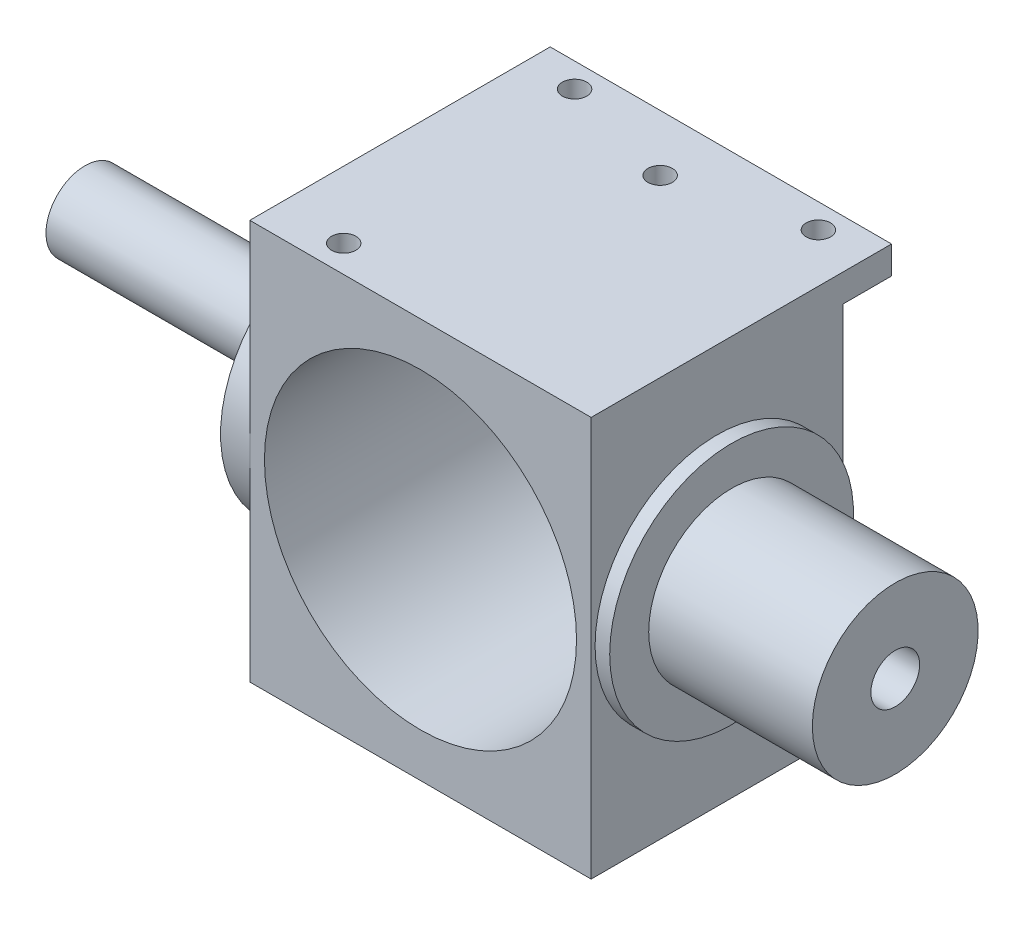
ISO-10303-21;
HEADER;
FILE_DESCRIPTION(('STEP AP214'),'2;1');
FILE_NAME('part.step','',(''),(''),'','','');
FILE_SCHEMA(('AUTOMOTIVE_DESIGN { 1 0 10303 214 1 1 1 1 }'));
ENDSEC;
DATA;
#1=APPLICATION_CONTEXT('core data for automotive mechanical design processes');
#2=APPLICATION_PROTOCOL_DEFINITION('international standard','automotive_design',2000,#1);
#3=PRODUCT_CONTEXT('',#1,'mechanical');
#4=PRODUCT('Part','Part','',(#3));
#5=PRODUCT_RELATED_PRODUCT_CATEGORY('part','',(#4));
#6=PRODUCT_DEFINITION_FORMATION('','',#4);
#7=PRODUCT_DEFINITION_CONTEXT('part definition',#1,'design');
#8=PRODUCT_DEFINITION('design','',#6,#7);
#9=PRODUCT_DEFINITION_SHAPE('','',#8);
#10=(LENGTH_UNIT() NAMED_UNIT(*) SI_UNIT(.MILLI.,.METRE.));
#11=(NAMED_UNIT(*) PLANE_ANGLE_UNIT() SI_UNIT($,.RADIAN.));
#12=(NAMED_UNIT(*) SI_UNIT($,.STERADIAN.) SOLID_ANGLE_UNIT());
#13=UNCERTAINTY_MEASURE_WITH_UNIT(LENGTH_MEASURE(1.E-05),#10,'distance_accuracy_value','');
#14=(GEOMETRIC_REPRESENTATION_CONTEXT(3) GLOBAL_UNCERTAINTY_ASSIGNED_CONTEXT((#13)) GLOBAL_UNIT_ASSIGNED_CONTEXT((#10,
#11,#12)) REPRESENTATION_CONTEXT('',''));
#15=CARTESIAN_POINT('',(0.,0.,0.));
#16=DIRECTION('',(0.,0.,1.));
#17=DIRECTION('',(1.,0.,0.));
#18=AXIS2_PLACEMENT_3D('',#15,#16,#17);
#19=CARTESIAN_POINT('',(53.5807438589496,27.618402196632,37.7129267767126));
#20=DIRECTION('',(-1.,0.,0.));
#21=DIRECTION('',(0.,0.,1.));
#22=AXIS2_PLACEMENT_3D('',#19,#20,#21);
#23=CYLINDRICAL_SURFACE('',#22,8.5);
#24=CARTESIAN_POINT('',(53.5807438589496,27.618402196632,37.7129267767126));
#25=DIRECTION('',(-1.,0.,0.));
#26=DIRECTION('',(0.,0.,1.));
#27=AXIS2_PLACEMENT_3D('',#24,#25,#26);
#28=CIRCLE('',#27,8.5);
#29=CARTESIAN_POINT('',(53.5807438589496,27.618402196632,46.2129267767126));
#30=VERTEX_POINT('',#29);
#31=EDGE_CURVE('E11',#30,#30,#28,.T.);
#32=ORIENTED_EDGE('',*,*,#31,.T.);
#33=EDGE_LOOP('',(#32));
#34=FACE_BOUND('',#33,.T.);
#35=CARTESIAN_POINT('',(36.7995438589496,27.618402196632,37.7129267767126));
#36=DIRECTION('',(-1.,0.,0.));
#37=DIRECTION('',(0.,0.,1.));
#38=AXIS2_PLACEMENT_3D('',#35,#36,#37);
#39=CIRCLE('',#38,8.5);
#40=CARTESIAN_POINT('',(36.7995438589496,27.618402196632,46.2129267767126));
#41=VERTEX_POINT('',#40);
#42=EDGE_CURVE('E56',#41,#41,#39,.T.);
#43=ORIENTED_EDGE('',*,*,#42,.F.);
#44=EDGE_LOOP('',(#43));
#45=FACE_BOUND('',#44,.T.);
#46=ADVANCED_FACE('F42',(#34,#45),#23,.T.);
#47=CARTESIAN_POINT('',(53.5807438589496,36.118402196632,37.7129267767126));
#48=DIRECTION('',(1.,0.,0.));
#49=DIRECTION('',(0.,0.,-1.));
#50=AXIS2_PLACEMENT_3D('',#47,#48,#49);
#51=PLANE('',#50);
#52=CARTESIAN_POINT('',(53.5807438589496,27.618402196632,37.7129267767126));
#53=DIRECTION('',(1.,0.,0.));
#54=DIRECTION('',(0.,0.,-1.));
#55=AXIS2_PLACEMENT_3D('',#52,#53,#54);
#56=CIRCLE('',#55,2.49999999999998);
#57=CARTESIAN_POINT('',(53.5807438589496,27.618402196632,35.2129267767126));
#58=VERTEX_POINT('',#57);
#59=EDGE_CURVE('E64',#58,#58,#56,.T.);
#60=ORIENTED_EDGE('',*,*,#59,.F.);
#61=EDGE_LOOP('',(#60));
#62=FACE_BOUND('',#61,.T.);
#63=ORIENTED_EDGE('',*,*,#31,.F.);
#64=EDGE_LOOP('',(#63));
#65=FACE_BOUND('',#64,.T.);
#66=ADVANCED_FACE('F71',(#62,#65),#51,.T.);
#67=CARTESIAN_POINT('',(35.2995438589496,27.618402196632,37.7129267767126));
#68=DIRECTION('',(-1.,0.,0.));
#69=DIRECTION('',(0.,0.,1.));
#70=AXIS2_PLACEMENT_3D('',#67,#68,#69);
#71=PLANE('',#70);
#72=CARTESIAN_POINT('',(35.2995438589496,27.618402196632,37.7129267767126));
#73=DIRECTION('',(-1.,0.,0.));
#74=DIRECTION('',(0.,0.,1.));
#75=AXIS2_PLACEMENT_3D('',#72,#73,#74);
#76=CIRCLE('',#75,2.49999999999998);
#77=CARTESIAN_POINT('',(35.2995438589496,27.618402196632,40.2129267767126));
#78=VERTEX_POINT('',#77);
#79=EDGE_CURVE('E61',#78,#78,#76,.T.);
#80=ORIENTED_EDGE('',*,*,#79,.F.);
#81=EDGE_LOOP('',(#80));
#82=FACE_BOUND('',#81,.T.);
#83=CARTESIAN_POINT('',(35.2995438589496,27.618402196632,37.7129267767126));
#84=DIRECTION('',(-1.,0.,0.));
#85=DIRECTION('',(0.,0.,1.));
#86=AXIS2_PLACEMENT_3D('',#83,#84,#85);
#87=CIRCLE('',#86,12.5);
#88=CARTESIAN_POINT('',(35.2995438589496,27.618402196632,50.2129267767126));
#89=VERTEX_POINT('',#88);
#90=EDGE_CURVE('E48',#89,#89,#87,.T.);
#91=ORIENTED_EDGE('',*,*,#90,.T.);
#92=EDGE_LOOP('',(#91));
#93=FACE_BOUND('',#92,.T.);
#94=ADVANCED_FACE('F74',(#82,#93),#71,.T.);
#95=CARTESIAN_POINT('',(53.5807438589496,27.618402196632,37.7129267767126));
#96=DIRECTION('',(-1.,0.,0.));
#97=DIRECTION('',(0.,0.,1.));
#98=AXIS2_PLACEMENT_3D('',#95,#96,#97);
#99=CYLINDRICAL_SURFACE('',#98,12.5);
#100=CARTESIAN_POINT('',(36.7995438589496,27.618402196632,37.7129267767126));
#101=DIRECTION('',(-1.,0.,0.));
#102=DIRECTION('',(0.,0.,1.));
#103=AXIS2_PLACEMENT_3D('',#100,#101,#102);
#104=CIRCLE('',#103,12.5);
#105=CARTESIAN_POINT('',(36.7995438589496,27.618402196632,50.2129267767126));
#106=VERTEX_POINT('',#105);
#107=EDGE_CURVE('E52',#106,#106,#104,.T.);
#108=ORIENTED_EDGE('',*,*,#107,.T.);
#109=EDGE_LOOP('',(#108));
#110=FACE_BOUND('',#109,.T.);
#111=ORIENTED_EDGE('',*,*,#90,.F.);
#112=EDGE_LOOP('',(#111));
#113=FACE_BOUND('',#112,.T.);
#114=ADVANCED_FACE('F79',(#110,#113),#99,.T.);
#115=CARTESIAN_POINT('',(36.7995438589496,40.118402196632,37.7129267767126));
#116=DIRECTION('',(1.,0.,0.));
#117=DIRECTION('',(0.,0.,-1.));
#118=AXIS2_PLACEMENT_3D('',#115,#116,#117);
#119=PLANE('',#118);
#120=ORIENTED_EDGE('',*,*,#42,.T.);
#121=EDGE_LOOP('',(#120));
#122=FACE_BOUND('',#121,.T.);
#123=ORIENTED_EDGE('',*,*,#107,.F.);
#124=EDGE_LOOP('',(#123));
#125=FACE_BOUND('',#124,.T.);
#126=ADVANCED_FACE('F85',(#122,#125),#119,.T.);
#127=CARTESIAN_POINT('',(53.5807438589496,27.618402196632,37.7129267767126));
#128=DIRECTION('',(1.,0.,0.));
#129=DIRECTION('',(0.,0.,-1.));
#130=AXIS2_PLACEMENT_3D('',#127,#128,#129);
#131=CYLINDRICAL_SURFACE('',#130,2.49999999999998);
#132=ORIENTED_EDGE('',*,*,#59,.T.);
#133=EDGE_LOOP('',(#132));
#134=FACE_BOUND('',#133,.T.);
#135=ORIENTED_EDGE('',*,*,#79,.T.);
#136=EDGE_LOOP('',(#135));
#137=FACE_BOUND('',#136,.T.);
#138=ADVANCED_FACE('F68',(#134,#137),#131,.F.);
#139=CLOSED_SHELL('',(#46,#66,#94,#114,#126,#138));
#140=MANIFOLD_SOLID_BREP('B2',#139);
#141=CARTESIAN_POINT('',(0.,0.,19.8129267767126));
#142=DIRECTION('',(0.,0.,-1.));
#143=DIRECTION('',(-1.,0.,0.));
#144=AXIS2_PLACEMENT_3D('',#141,#142,#143);
#145=PLANE('',#144);
#146=DIRECTION('',(-1.,0.,0.));
#147=VECTOR('',#146,1.);
#148=CARTESIAN_POINT('',(0.,10.118402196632,19.8129267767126));
#149=LINE('',#148,#147);
#150=CARTESIAN_POINT('',(35.2995438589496,10.118402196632,19.8129267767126));
#151=VERTEX_POINT('',#150);
#152=CARTESIAN_POINT('',(0.299543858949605,10.118402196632,19.8129267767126));
#153=VERTEX_POINT('',#152);
#154=EDGE_CURVE('E153',#151,#153,#149,.T.);
#155=ORIENTED_EDGE('',*,*,#154,.F.);
#156=DIRECTION('',(0.,-1.,0.));
#157=VECTOR('',#156,1.);
#158=CARTESIAN_POINT('',(35.2995438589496,48.118402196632,19.8129267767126));
#159=LINE('',#158,#157);
#160=CARTESIAN_POINT('',(35.2995438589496,7.11840219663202,19.8129267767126));
#161=VERTEX_POINT('',#160);
#162=EDGE_CURVE('E280',#151,#161,#159,.T.);
#163=ORIENTED_EDGE('',*,*,#162,.T.);
#164=DIRECTION('',(-1.,0.,0.));
#165=VECTOR('',#164,1.);
#166=CARTESIAN_POINT('',(35.2995438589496,7.11840219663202,19.8129267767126));
#167=LINE('',#166,#165);
#168=CARTESIAN_POINT('',(0.299543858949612,7.11840219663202,19.8129267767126));
#169=VERTEX_POINT('',#168);
#170=EDGE_CURVE('E264',#161,#169,#167,.T.);
#171=ORIENTED_EDGE('',*,*,#170,.T.);
#172=DIRECTION('',(0.,1.,0.));
#173=VECTOR('',#172,1.);
#174=CARTESIAN_POINT('',(0.299543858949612,7.11840219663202,19.8129267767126));
#175=LINE('',#174,#173);
#176=EDGE_CURVE('E274',#169,#153,#175,.T.);
#177=ORIENTED_EDGE('',*,*,#176,.T.);
#178=EDGE_LOOP('',(#155,#163,#171,#177));
#179=FACE_BOUND('',#178,.T.);
#180=ADVANCED_FACE('F141',(#179),#145,.T.);
#181=CARTESIAN_POINT('',(0.299543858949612,7.11840219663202,50.6129267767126));
#182=DIRECTION('',(-1.,0.,0.));
#183=DIRECTION('',(0.,-1.,0.));
#184=AXIS2_PLACEMENT_3D('',#181,#182,#183);
#185=PLANE('',#184);
#186=DIRECTION('',(0.,0.,1.));
#187=VECTOR('',#186,1.);
#188=CARTESIAN_POINT('',(0.299543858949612,10.118402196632,50.6129267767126));
#189=LINE('',#188,#187);
#190=CARTESIAN_POINT('',(0.299543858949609,10.118402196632,24.8129267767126));
#191=VERTEX_POINT('',#190);
#192=EDGE_CURVE('E255',#153,#191,#189,.T.);
#193=ORIENTED_EDGE('',*,*,#192,.F.);
#194=ORIENTED_EDGE('',*,*,#176,.F.);
#195=DIRECTION('',(0.,0.,-1.));
#196=VECTOR('',#195,1.);
#197=CARTESIAN_POINT('',(0.299543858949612,7.11840219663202,50.6129267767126));
#198=LINE('',#197,#196);
#199=CARTESIAN_POINT('',(0.299543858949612,7.11840219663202,50.6129267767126));
#200=VERTEX_POINT('',#199);
#201=EDGE_CURVE('E286',#200,#169,#198,.T.);
#202=ORIENTED_EDGE('',*,*,#201,.F.);
#203=DIRECTION('',(0.,1.,0.));
#204=VECTOR('',#203,1.);
#205=CARTESIAN_POINT('',(0.299543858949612,7.11840219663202,50.6129267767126));
#206=LINE('',#205,#204);
#207=CARTESIAN_POINT('',(0.299543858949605,48.118402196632,50.6129267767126));
#208=VERTEX_POINT('',#207);
#209=EDGE_CURVE('E260',#200,#208,#206,.T.);
#210=ORIENTED_EDGE('',*,*,#209,.T.);
#211=DIRECTION('',(0.,0.,-1.));
#212=VECTOR('',#211,1.);
#213=CARTESIAN_POINT('',(0.299543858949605,48.118402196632,50.6129267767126));
#214=LINE('',#213,#212);
#215=CARTESIAN_POINT('',(0.299543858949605,48.118402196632,19.8129267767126));
#216=VERTEX_POINT('',#215);
#217=EDGE_CURVE('E273',#208,#216,#214,.T.);
#218=ORIENTED_EDGE('',*,*,#217,.T.);
#219=CARTESIAN_POINT('',(0.299543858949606,45.272002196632,19.8129267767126));
#220=VERTEX_POINT('',#219);
#221=EDGE_CURVE('E259',#220,#216,#175,.T.);
#222=ORIENTED_EDGE('',*,*,#221,.F.);
#223=DIRECTION('',(0.,0.,-1.));
#224=VECTOR('',#223,1.);
#225=CARTESIAN_POINT('',(0.299543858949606,45.272002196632,50.6129267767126));
#226=LINE('',#225,#224);
#227=CARTESIAN_POINT('',(0.299543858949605,45.272002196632,24.8129267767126));
#228=VERTEX_POINT('',#227);
#229=EDGE_CURVE('E167',#228,#220,#226,.T.);
#230=ORIENTED_EDGE('',*,*,#229,.F.);
#231=DIRECTION('',(0.,1.,0.));
#232=VECTOR('',#231,1.);
#233=CARTESIAN_POINT('',(0.299543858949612,7.11840219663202,24.8129267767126));
#234=LINE('',#233,#232);
#235=EDGE_CURVE('E257',#191,#228,#234,.T.);
#236=ORIENTED_EDGE('',*,*,#235,.F.);
#237=EDGE_LOOP('',(#193,#194,#202,#210,#218,#222,#230,#236));
#238=FACE_BOUND('',#237,.T.);
#239=ADVANCED_FACE('F345',(#238),#185,.T.);
#240=CARTESIAN_POINT('',(35.2995438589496,7.11840219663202,50.6129267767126));
#241=DIRECTION('',(0.,-1.,0.));
#242=DIRECTION('',(0.,0.,-1.));
#243=AXIS2_PLACEMENT_3D('',#240,#241,#242);
#244=PLANE('',#243);
#245=CARTESIAN_POINT('',(5.29954385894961,7.11840219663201,22.3129267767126));
#246=DIRECTION('',(0.,1.,0.));
#247=DIRECTION('',(0.,0.,1.));
#248=AXIS2_PLACEMENT_3D('',#245,#246,#247);
#249=CIRCLE('',#248,1.24999999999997);
#250=CARTESIAN_POINT('',(5.29954385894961,7.11840219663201,23.5629267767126));
#251=VERTEX_POINT('',#250);
#252=EDGE_CURVE('E409',#251,#251,#249,.T.);
#253=ORIENTED_EDGE('',*,*,#252,.T.);
#254=EDGE_LOOP('',(#253));
#255=FACE_BOUND('',#254,.T.);
#256=CARTESIAN_POINT('',(30.2995438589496,7.11840219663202,22.3129267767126));
#257=DIRECTION('',(0.,1.,0.));
#258=DIRECTION('',(0.,0.,1.));
#259=AXIS2_PLACEMENT_3D('',#256,#257,#258);
#260=CIRCLE('',#259,1.24999999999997);
#261=CARTESIAN_POINT('',(30.2995438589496,7.11840219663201,23.5629267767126));
#262=VERTEX_POINT('',#261);
#263=EDGE_CURVE('E403',#262,#262,#260,.T.);
#264=ORIENTED_EDGE('',*,*,#263,.T.);
#265=EDGE_LOOP('',(#264));
#266=FACE_BOUND('',#265,.T.);
#267=ORIENTED_EDGE('',*,*,#170,.F.);
#268=DIRECTION('',(0.,0.,-1.));
#269=VECTOR('',#268,1.);
#270=CARTESIAN_POINT('',(35.2995438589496,7.11840219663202,50.6129267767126));
#271=LINE('',#270,#269);
#272=CARTESIAN_POINT('',(35.2995438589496,7.11840219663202,50.6129267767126));
#273=VERTEX_POINT('',#272);
#274=EDGE_CURVE('E289',#273,#161,#271,.T.);
#275=ORIENTED_EDGE('',*,*,#274,.F.);
#276=DIRECTION('',(-1.,0.,0.));
#277=VECTOR('',#276,1.);
#278=CARTESIAN_POINT('',(35.2995438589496,7.11840219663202,50.6129267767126));
#279=LINE('',#278,#277);
#280=EDGE_CURVE('E270',#273,#200,#279,.T.);
#281=ORIENTED_EDGE('',*,*,#280,.T.);
#282=ORIENTED_EDGE('',*,*,#201,.T.);
#283=EDGE_LOOP('',(#267,#275,#281,#282));
#284=FACE_BOUND('',#283,.T.);
#285=ADVANCED_FACE('F352',(#255,#266,#284),#244,.T.);
#286=CARTESIAN_POINT('',(35.2995438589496,48.118402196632,50.6129267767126));
#287=DIRECTION('',(1.,0.,0.));
#288=DIRECTION('',(0.,1.,0.));
#289=AXIS2_PLACEMENT_3D('',#286,#287,#288);
#290=PLANE('',#289);
#291=CARTESIAN_POINT('',(35.2995438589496,27.618402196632,37.7129267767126));
#292=DIRECTION('',(1.,0.,0.));
#293=DIRECTION('',(0.,1.,0.));
#294=AXIS2_PLACEMENT_3D('',#291,#292,#293);
#295=CIRCLE('',#294,2.49999999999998);
#296=CARTESIAN_POINT('',(35.2995438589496,30.118402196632,37.7129267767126));
#297=VERTEX_POINT('',#296);
#298=EDGE_CURVE('E241',#297,#297,#295,.T.);
#299=ORIENTED_EDGE('',*,*,#298,.F.);
#300=EDGE_LOOP('',(#299));
#301=FACE_BOUND('',#300,.T.);
#302=DIRECTION('',(0.,0.,-1.));
#303=VECTOR('',#302,1.);
#304=CARTESIAN_POINT('',(35.2995438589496,10.118402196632,24.8129267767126));
#305=LINE('',#304,#303);
#306=CARTESIAN_POINT('',(35.2995438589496,10.118402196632,24.8129267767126));
#307=VERTEX_POINT('',#306);
#308=EDGE_CURVE('E235',#307,#151,#305,.T.);
#309=ORIENTED_EDGE('',*,*,#308,.F.);
#310=DIRECTION('',(0.,-1.,0.));
#311=VECTOR('',#310,1.);
#312=CARTESIAN_POINT('',(35.2995438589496,45.272002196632,24.8129267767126));
#313=LINE('',#312,#311);
#314=CARTESIAN_POINT('',(35.2995438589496,45.272002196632,24.8129267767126));
#315=VERTEX_POINT('',#314);
#316=EDGE_CURVE('E247',#315,#307,#313,.T.);
#317=ORIENTED_EDGE('',*,*,#316,.F.);
#318=DIRECTION('',(0.,0.,1.));
#319=VECTOR('',#318,1.);
#320=CARTESIAN_POINT('',(35.2995438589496,45.272002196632,19.8129267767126));
#321=LINE('',#320,#319);
#322=CARTESIAN_POINT('',(35.2995438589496,45.272002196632,19.8129267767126));
#323=VERTEX_POINT('',#322);
#324=EDGE_CURVE('E238',#323,#315,#321,.T.);
#325=ORIENTED_EDGE('',*,*,#324,.F.);
#326=CARTESIAN_POINT('',(35.2995438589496,48.118402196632,19.8129267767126));
#327=VERTEX_POINT('',#326);
#328=EDGE_CURVE('E281',#327,#323,#159,.T.);
#329=ORIENTED_EDGE('',*,*,#328,.F.);
#330=DIRECTION('',(0.,0.,-1.));
#331=VECTOR('',#330,1.);
#332=CARTESIAN_POINT('',(35.2995438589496,48.118402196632,50.6129267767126));
#333=LINE('',#332,#331);
#334=CARTESIAN_POINT('',(35.2995438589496,48.118402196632,50.6129267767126));
#335=VERTEX_POINT('',#334);
#336=EDGE_CURVE('E292',#335,#327,#333,.T.);
#337=ORIENTED_EDGE('',*,*,#336,.F.);
#338=DIRECTION('',(0.,-1.,0.));
#339=VECTOR('',#338,1.);
#340=CARTESIAN_POINT('',(35.2995438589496,48.118402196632,50.6129267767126));
#341=LINE('',#340,#339);
#342=EDGE_CURVE('E267',#335,#273,#341,.T.);
#343=ORIENTED_EDGE('',*,*,#342,.T.);
#344=ORIENTED_EDGE('',*,*,#274,.T.);
#345=ORIENTED_EDGE('',*,*,#162,.F.);
#346=EDGE_LOOP('',(#309,#317,#325,#329,#337,#343,#344,#345));
#347=FACE_BOUND('',#346,.T.);
#348=ADVANCED_FACE('F381',(#301,#347),#290,.T.);
#349=CARTESIAN_POINT('',(0.299543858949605,48.118402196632,50.6129267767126));
#350=DIRECTION('',(0.,1.,0.));
#351=DIRECTION('',(0.,0.,1.));
#352=AXIS2_PLACEMENT_3D('',#349,#350,#351);
#353=PLANE('',#352);
#354=CARTESIAN_POINT('',(5.29954385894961,48.118402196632,22.3129267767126));
#355=DIRECTION('',(0.,-1.,0.));
#356=DIRECTION('',(0.,0.,-1.));
#357=AXIS2_PLACEMENT_3D('',#354,#355,#356);
#358=CIRCLE('',#357,1.24999999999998);
#359=CARTESIAN_POINT('',(5.29954385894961,48.118402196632,21.0629267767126));
#360=VERTEX_POINT('',#359);
#361=EDGE_CURVE('E397',#360,#360,#358,.T.);
#362=ORIENTED_EDGE('',*,*,#361,.T.);
#363=EDGE_LOOP('',(#362));
#364=FACE_BOUND('',#363,.T.);
#365=CARTESIAN_POINT('',(30.2995438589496,48.118402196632,22.3129267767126));
#366=DIRECTION('',(0.,-1.,0.));
#367=DIRECTION('',(0.,0.,-1.));
#368=AXIS2_PLACEMENT_3D('',#365,#366,#367);
#369=CIRCLE('',#368,1.24999999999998);
#370=CARTESIAN_POINT('',(30.2995438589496,48.118402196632,21.0629267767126));
#371=VERTEX_POINT('',#370);
#372=EDGE_CURVE('E391',#371,#371,#369,.T.);
#373=ORIENTED_EDGE('',*,*,#372,.T.);
#374=EDGE_LOOP('',(#373));
#375=FACE_BOUND('',#374,.T.);
#376=CARTESIAN_POINT('',(17.3495438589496,48.118402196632,25.5879267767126));
#377=DIRECTION('',(0.,1.,0.));
#378=DIRECTION('',(0.,0.,1.));
#379=AXIS2_PLACEMENT_3D('',#376,#377,#378);
#380=CIRCLE('',#379,1.24999999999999);
#381=CARTESIAN_POINT('',(17.3495438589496,48.118402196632,26.8379267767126));
#382=VERTEX_POINT('',#381);
#383=EDGE_CURVE('E232',#382,#382,#380,.T.);
#384=ORIENTED_EDGE('',*,*,#383,.F.);
#385=EDGE_LOOP('',(#384));
#386=FACE_BOUND('',#385,.T.);
#387=CARTESIAN_POINT('',(7.1495438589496,48.118402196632,47.8379267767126));
#388=DIRECTION('',(0.,1.,0.));
#389=DIRECTION('',(0.,0.,1.));
#390=AXIS2_PLACEMENT_3D('',#387,#388,#389);
#391=CIRCLE('',#390,1.24999999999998);
#392=CARTESIAN_POINT('',(7.1495438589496,48.118402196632,49.0879267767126));
#393=VERTEX_POINT('',#392);
#394=EDGE_CURVE('E306',#393,#393,#391,.T.);
#395=ORIENTED_EDGE('',*,*,#394,.F.);
#396=EDGE_LOOP('',(#395));
#397=FACE_BOUND('',#396,.T.);
#398=DIRECTION('',(1.,0.,0.));
#399=VECTOR('',#398,1.);
#400=CARTESIAN_POINT('',(0.299543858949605,48.118402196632,19.8129267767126));
#401=LINE('',#400,#399);
#402=EDGE_CURVE('E277',#216,#327,#401,.T.);
#403=ORIENTED_EDGE('',*,*,#402,.F.);
#404=ORIENTED_EDGE('',*,*,#217,.F.);
#405=DIRECTION('',(1.,0.,0.));
#406=VECTOR('',#405,1.);
#407=CARTESIAN_POINT('',(0.299543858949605,48.118402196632,50.6129267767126));
#408=LINE('',#407,#406);
#409=EDGE_CURVE('E263',#208,#335,#408,.T.);
#410=ORIENTED_EDGE('',*,*,#409,.T.);
#411=ORIENTED_EDGE('',*,*,#336,.T.);
#412=EDGE_LOOP('',(#403,#404,#410,#411));
#413=FACE_BOUND('',#412,.T.);
#414=ADVANCED_FACE('F367',(#364,#375,#386,#397,#413),#353,.T.);
#415=CARTESIAN_POINT('',(0.,0.,50.6129267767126));
#416=DIRECTION('',(0.,0.,-1.));
#417=DIRECTION('',(-1.,0.,0.));
#418=AXIS2_PLACEMENT_3D('',#415,#416,#417);
#419=PLANE('',#418);
#420=CARTESIAN_POINT('',(17.7995438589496,27.618402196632,50.6129267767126));
#421=DIRECTION('',(0.,0.,1.));
#422=DIRECTION('',(1.,0.,0.));
#423=AXIS2_PLACEMENT_3D('',#420,#421,#422);
#424=CIRCLE('',#423,16.);
#425=CARTESIAN_POINT('',(33.7995438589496,27.618402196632,50.6129267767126));
#426=VERTEX_POINT('',#425);
#427=EDGE_CURVE('E236',#426,#426,#424,.T.);
#428=ORIENTED_EDGE('',*,*,#427,.F.);
#429=EDGE_LOOP('',(#428));
#430=FACE_BOUND('',#429,.T.);
#431=ORIENTED_EDGE('',*,*,#209,.F.);
#432=ORIENTED_EDGE('',*,*,#280,.F.);
#433=ORIENTED_EDGE('',*,*,#342,.F.);
#434=ORIENTED_EDGE('',*,*,#409,.F.);
#435=EDGE_LOOP('',(#431,#432,#433,#434));
#436=FACE_BOUND('',#435,.T.);
#437=ADVANCED_FACE('F359',(#430,#436),#419,.F.);
#438=DIRECTION('',(1.,0.,0.));
#439=VECTOR('',#438,1.);
#440=CARTESIAN_POINT('',(0.,45.272002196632,19.8129267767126));
#441=LINE('',#440,#439);
#442=EDGE_CURVE('E288',#220,#323,#441,.T.);
#443=ORIENTED_EDGE('',*,*,#442,.F.);
#444=ORIENTED_EDGE('',*,*,#221,.T.);
#445=ORIENTED_EDGE('',*,*,#402,.T.);
#446=ORIENTED_EDGE('',*,*,#328,.T.);
#447=EDGE_LOOP('',(#443,#444,#445,#446));
#448=FACE_BOUND('',#447,.T.);
#449=ADVANCED_FACE('F348',(#448),#145,.T.);
#450=CARTESIAN_POINT('',(-29.5004561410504,10.118402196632,24.8129267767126));
#451=DIRECTION('',(0.,-1.,0.));
#452=DIRECTION('',(0.,0.,-1.));
#453=AXIS2_PLACEMENT_3D('',#450,#451,#452);
#454=PLANE('',#453);
#455=CARTESIAN_POINT('',(5.29954385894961,10.118402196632,22.3129267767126));
#456=DIRECTION('',(0.,1.,0.));
#457=DIRECTION('',(0.,0.,1.));
#458=AXIS2_PLACEMENT_3D('',#455,#456,#457);
#459=CIRCLE('',#458,1.24999999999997);
#460=CARTESIAN_POINT('',(5.29954385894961,10.118402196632,23.5629267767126));
#461=VERTEX_POINT('',#460);
#462=EDGE_CURVE('E412',#461,#461,#459,.T.);
#463=ORIENTED_EDGE('',*,*,#462,.F.);
#464=EDGE_LOOP('',(#463));
#465=FACE_BOUND('',#464,.T.);
#466=CARTESIAN_POINT('',(30.2995438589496,10.118402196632,22.3129267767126));
#467=DIRECTION('',(0.,1.,0.));
#468=DIRECTION('',(0.,0.,1.));
#469=AXIS2_PLACEMENT_3D('',#466,#467,#468);
#470=CIRCLE('',#469,1.24999999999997);
#471=CARTESIAN_POINT('',(30.2995438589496,10.118402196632,23.5629267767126));
#472=VERTEX_POINT('',#471);
#473=EDGE_CURVE('E406',#472,#472,#470,.T.);
#474=ORIENTED_EDGE('',*,*,#473,.F.);
#475=EDGE_LOOP('',(#474));
#476=FACE_BOUND('',#475,.T.);
#477=ORIENTED_EDGE('',*,*,#192,.T.);
#478=DIRECTION('',(1.,0.,0.));
#479=VECTOR('',#478,1.);
#480=CARTESIAN_POINT('',(-29.5004561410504,10.118402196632,24.8129267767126));
#481=LINE('',#480,#479);
#482=EDGE_CURVE('E251',#191,#307,#481,.T.);
#483=ORIENTED_EDGE('',*,*,#482,.T.);
#484=ORIENTED_EDGE('',*,*,#308,.T.);
#485=ORIENTED_EDGE('',*,*,#154,.T.);
#486=EDGE_LOOP('',(#477,#483,#484,#485));
#487=FACE_BOUND('',#486,.T.);
#488=ADVANCED_FACE('F358',(#465,#476,#487),#454,.F.);
#489=CARTESIAN_POINT('',(-29.5004561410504,45.272002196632,24.8129267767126));
#490=DIRECTION('',(0.,0.,1.));
#491=DIRECTION('',(1.,0.,0.));
#492=AXIS2_PLACEMENT_3D('',#489,#490,#491);
#493=PLANE('',#492);
#494=CARTESIAN_POINT('',(17.7995438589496,27.618402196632,24.8129267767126));
#495=DIRECTION('',(0.,0.,1.));
#496=DIRECTION('',(1.,0.,0.));
#497=AXIS2_PLACEMENT_3D('',#494,#495,#496);
#498=CIRCLE('',#497,16.);
#499=CARTESIAN_POINT('',(16.3687915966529,43.554303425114,24.8129267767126));
#500=VERTEX_POINT('',#499);
#501=CARTESIAN_POINT('',(18.3302961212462,43.6095967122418,24.8129267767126));
#502=VERTEX_POINT('',#501);
#503=EDGE_CURVE('E229',#500,#502,#498,.T.);
#504=ORIENTED_EDGE('',*,*,#503,.T.);
#505=DIRECTION('',(0.,1.,0.));
#506=VECTOR('',#505,1.);
#507=CARTESIAN_POINT('',(18.3302961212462,48.118402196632,24.8129267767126));
#508=LINE('',#507,#506);
#509=CARTESIAN_POINT('',(18.3302961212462,45.272002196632,24.8129267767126));
#510=VERTEX_POINT('',#509);
#511=EDGE_CURVE('E160',#502,#510,#508,.T.);
#512=ORIENTED_EDGE('',*,*,#511,.T.);
#513=DIRECTION('',(1.,0.,0.));
#514=VECTOR('',#513,1.);
#515=CARTESIAN_POINT('',(-29.5004561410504,45.272002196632,24.8129267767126));
#516=LINE('',#515,#514);
#517=EDGE_CURVE('E250',#510,#315,#516,.T.);
#518=ORIENTED_EDGE('',*,*,#517,.T.);
#519=ORIENTED_EDGE('',*,*,#316,.T.);
#520=ORIENTED_EDGE('',*,*,#482,.F.);
#521=ORIENTED_EDGE('',*,*,#235,.T.);
#522=CARTESIAN_POINT('',(16.3687915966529,45.272002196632,24.8129267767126));
#523=VERTEX_POINT('',#522);
#524=EDGE_CURVE('E230',#228,#523,#516,.T.);
#525=ORIENTED_EDGE('',*,*,#524,.T.);
#526=DIRECTION('',(0.,1.,0.));
#527=VECTOR('',#526,1.);
#528=CARTESIAN_POINT('',(16.3687915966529,48.118402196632,24.8129267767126));
#529=LINE('',#528,#527);
#530=EDGE_CURVE('E221',#523,#500,#529,.F.);
#531=ORIENTED_EDGE('',*,*,#530,.T.);
#532=EDGE_LOOP('',(#504,#512,#518,#519,#520,#521,#525,#531));
#533=FACE_BOUND('',#532,.T.);
#534=ADVANCED_FACE('F228',(#533),#493,.F.);
#535=CARTESIAN_POINT('',(-29.5004561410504,45.272002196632,19.8129267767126));
#536=DIRECTION('',(0.,1.,0.));
#537=DIRECTION('',(-1.,0.,0.));
#538=AXIS2_PLACEMENT_3D('',#535,#536,#537);
#539=PLANE('',#538);
#540=CARTESIAN_POINT('',(5.29954385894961,45.272002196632,22.3129267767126));
#541=DIRECTION('',(0.,-1.,0.));
#542=DIRECTION('',(0.,0.,-1.));
#543=AXIS2_PLACEMENT_3D('',#540,#541,#542);
#544=CIRCLE('',#543,1.24999999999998);
#545=CARTESIAN_POINT('',(5.29954385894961,45.272002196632,21.0629267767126));
#546=VERTEX_POINT('',#545);
#547=EDGE_CURVE('E400',#546,#546,#544,.T.);
#548=ORIENTED_EDGE('',*,*,#547,.F.);
#549=EDGE_LOOP('',(#548));
#550=FACE_BOUND('',#549,.T.);
#551=CARTESIAN_POINT('',(30.2995438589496,45.272002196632,22.3129267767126));
#552=DIRECTION('',(0.,-1.,0.));
#553=DIRECTION('',(0.,0.,-1.));
#554=AXIS2_PLACEMENT_3D('',#551,#552,#553);
#555=CIRCLE('',#554,1.24999999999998);
#556=CARTESIAN_POINT('',(30.2995438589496,45.272002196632,21.0629267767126));
#557=VERTEX_POINT('',#556);
#558=EDGE_CURVE('E394',#557,#557,#555,.T.);
#559=ORIENTED_EDGE('',*,*,#558,.F.);
#560=EDGE_LOOP('',(#559));
#561=FACE_BOUND('',#560,.T.);
#562=ORIENTED_EDGE('',*,*,#517,.F.);
#563=CARTESIAN_POINT('',(17.3495438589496,45.272002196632,25.5879267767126));
#564=DIRECTION('',(0.,1.,0.));
#565=DIRECTION('',(-1.,0.,0.));
#566=AXIS2_PLACEMENT_3D('',#563,#564,#565);
#567=CIRCLE('',#566,1.24999999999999);
#568=EDGE_CURVE('E231',#510,#523,#567,.T.);
#569=ORIENTED_EDGE('',*,*,#568,.T.);
#570=ORIENTED_EDGE('',*,*,#524,.F.);
#571=ORIENTED_EDGE('',*,*,#229,.T.);
#572=ORIENTED_EDGE('',*,*,#442,.T.);
#573=ORIENTED_EDGE('',*,*,#324,.T.);
#574=EDGE_LOOP('',(#562,#569,#570,#571,#572,#573));
#575=FACE_BOUND('',#574,.T.);
#576=ADVANCED_FACE('F384',(#550,#561,#575),#539,.F.);
#577=CARTESIAN_POINT('',(17.7995438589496,27.618402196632,50.6129267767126));
#578=DIRECTION('',(0.,0.,1.));
#579=DIRECTION('',(1.,0.,0.));
#580=AXIS2_PLACEMENT_3D('',#577,#578,#579);
#581=CYLINDRICAL_SURFACE('',#580,16.);
#582=CARTESIAN_POINT('',(7.1495438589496,39.5589842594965,49.0879267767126));
#583=CARTESIAN_POINT('',(7.22841025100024,39.6293251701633,49.0879275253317));
#584=CARTESIAN_POINT('',(7.30801002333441,39.698910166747,49.08047969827));
#585=CARTESIAN_POINT('',(7.46693001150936,39.8351136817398,49.0496689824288));
#586=CARTESIAN_POINT('',(7.54624984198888,39.9017289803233,49.0262892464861));
#587=CARTESIAN_POINT('',(7.68975799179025,40.0199943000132,48.9673982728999));
#588=CARTESIAN_POINT('',(7.75437030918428,40.0723540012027,48.9343609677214));
#589=CARTESIAN_POINT('',(7.87937715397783,40.1721529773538,48.8554186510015));
#590=CARTESIAN_POINT('',(7.93977830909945,40.2196000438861,48.8095344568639));
#591=CARTESIAN_POINT('',(8.04276631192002,40.2994395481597,48.7146130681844));
#592=CARTESIAN_POINT('',(8.08655324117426,40.3329771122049,48.6678478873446));
#593=CARTESIAN_POINT('',(8.16778471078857,40.3946228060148,48.5658877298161));
#594=CARTESIAN_POINT('',(8.20523034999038,40.4227318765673,48.5106942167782));
#595=CARTESIAN_POINT('',(8.27201780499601,40.472506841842,48.3921953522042));
#596=CARTESIAN_POINT('',(8.30128811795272,40.4941160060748,48.3288251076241));
#597=CARTESIAN_POINT('',(8.34919589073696,40.5293209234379,48.196107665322));
#598=CARTESIAN_POINT('',(8.36784493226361,40.5429254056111,48.1267670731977));
#599=CARTESIAN_POINT('',(8.39114320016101,40.5598924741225,47.9951784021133));
#600=CARTESIAN_POINT('',(8.39743922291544,40.5644606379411,47.9333734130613));
#601=CARTESIAN_POINT('',(8.40075279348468,40.5668667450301,47.8093958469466));
#602=CARTESIAN_POINT('',(8.39777496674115,40.5647080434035,47.7472234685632));
#603=CARTESIAN_POINT('',(8.38334866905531,40.5542181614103,47.6294308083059));
#604=CARTESIAN_POINT('',(8.37258362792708,40.5463849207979,47.5736793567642));
#605=CARTESIAN_POINT('',(8.34396222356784,40.5254656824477,47.4650743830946));
#606=CARTESIAN_POINT('',(8.32610549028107,40.512379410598,47.4122210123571));
#607=CARTESIAN_POINT('',(8.28334498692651,40.4808548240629,47.3085258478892));
#608=CARTESIAN_POINT('',(8.25818969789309,40.4622247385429,47.2578471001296));
#609=CARTESIAN_POINT('',(8.20230107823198,40.4205170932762,47.1616876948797));
#610=CARTESIAN_POINT('',(8.17156587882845,40.3974380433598,47.1162087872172));
#611=CARTESIAN_POINT('',(8.10134576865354,40.344247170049,47.025347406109));
#612=CARTESIAN_POINT('',(8.06124242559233,40.3136105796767,46.9807524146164));
#613=CARTESIAN_POINT('',(7.97684548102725,40.2484240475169,46.8990281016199));
#614=CARTESIAN_POINT('',(7.93254845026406,40.2138708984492,46.8619049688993));
#615=CARTESIAN_POINT('',(7.81961523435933,40.1247326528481,46.7794290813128));
#616=CARTESIAN_POINT('',(7.74928034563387,40.0683333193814,46.7383400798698));
#617=CARTESIAN_POINT('',(7.6054217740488,39.95082067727,46.6713099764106));
#618=CARTESIAN_POINT('',(7.5318934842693,39.8897004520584,46.6453915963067));
#619=CARTESIAN_POINT('',(7.38288887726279,39.7634819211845,46.6074635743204));
#620=CARTESIAN_POINT('',(7.30739969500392,39.6983399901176,46.5956531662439));
#621=CARTESIAN_POINT('',(7.15718685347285,39.5662162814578,46.5856843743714));
#622=CARTESIAN_POINT('',(7.08246332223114,39.4992342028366,46.5875282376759));
#623=CARTESIAN_POINT('',(6.91951180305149,39.3503879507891,46.6059935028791));
#624=CARTESIAN_POINT('',(6.83176211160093,39.2683664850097,46.6256516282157));
#625=CARTESIAN_POINT('',(6.66133793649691,39.105536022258,46.6836889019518));
#626=CARTESIAN_POINT('',(6.57866491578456,39.0247273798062,46.722073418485));
#627=CARTESIAN_POINT('',(6.43830312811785,38.8847138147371,46.807484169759));
#628=CARTESIAN_POINT('',(6.37913112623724,38.8246817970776,46.8507248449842));
#629=CARTESIAN_POINT('',(6.26696272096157,38.7092092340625,46.9495991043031));
#630=CARTESIAN_POINT('',(6.21395505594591,38.6537603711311,47.0052095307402));
#631=CARTESIAN_POINT('',(6.13101740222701,38.5659134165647,47.1111616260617));
#632=CARTESIAN_POINT('',(6.09890763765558,38.5315586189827,47.1581675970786));
#633=CARTESIAN_POINT('',(6.04022893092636,38.468303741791,47.2588726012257));
#634=CARTESIAN_POINT('',(6.01365193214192,38.4393957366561,47.3125617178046));
#635=CARTESIAN_POINT('',(5.97245995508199,38.3943394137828,47.4144479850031));
#636=CARTESIAN_POINT('',(5.95650734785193,38.3767882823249,47.4614763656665));
#637=CARTESIAN_POINT('',(5.93006427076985,38.3476074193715,47.5588117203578));
#638=CARTESIAN_POINT('',(5.91956915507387,38.3359726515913,47.60911586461));
#639=CARTESIAN_POINT('',(5.90479866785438,38.3195780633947,47.7121089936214));
#640=CARTESIAN_POINT('',(5.90056510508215,38.3148644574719,47.7648116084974));
#641=CARTESIAN_POINT('',(5.89885201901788,38.3129586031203,47.8704596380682));
#642=CARTESIAN_POINT('',(5.90137083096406,38.3157645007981,47.9234049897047));
#643=CARTESIAN_POINT('',(5.91231678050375,38.3279253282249,48.0222889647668));
#644=CARTESIAN_POINT('',(5.92011141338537,38.33657901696,48.0683892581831));
#645=CARTESIAN_POINT('',(5.94039892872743,38.359021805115,48.158227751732));
#646=CARTESIAN_POINT('',(5.95289387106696,38.3728131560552,48.2019649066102));
#647=CARTESIAN_POINT('',(5.98734876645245,38.4106640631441,48.3022171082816));
#648=CARTESIAN_POINT('',(6.01110089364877,38.4366348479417,48.3573928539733));
#649=CARTESIAN_POINT('',(6.06452385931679,38.4945626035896,48.4613572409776));
#650=CARTESIAN_POINT('',(6.09420670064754,38.5265317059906,48.5101325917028));
#651=CARTESIAN_POINT('',(6.17129496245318,38.6087683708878,48.6200435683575));
#652=CARTESIAN_POINT('',(6.22096517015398,38.661150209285,48.6779987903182));
#653=CARTESIAN_POINT('',(6.3267767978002,38.7710469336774,48.7818917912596));
#654=CARTESIAN_POINT('',(6.38293255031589,38.8285731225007,48.827802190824));
#655=CARTESIAN_POINT('',(6.51923298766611,38.9659448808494,48.9214910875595));
#656=CARTESIAN_POINT('',(6.60120687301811,39.046925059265,48.9649481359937));
#657=CARTESIAN_POINT('',(6.77074093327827,39.2106145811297,49.0326314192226));
#658=CARTESIAN_POINT('',(6.85829159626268,39.2933208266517,49.0568894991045));
#659=CARTESIAN_POINT('',(7.01408372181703,39.437119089,49.0823876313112));
#660=CARTESIAN_POINT('',(7.08154116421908,39.498332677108,49.0879261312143));
#661=CARTESIAN_POINT('',(7.1495438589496,39.5589842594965,49.0879267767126));
#662=B_SPLINE_CURVE_WITH_KNOTS('',3,(#582,#583,#584,#585,#586,#587,#588,#589,#590,#591,#592,
#593,#594,#595,#596,#597,#598,#599,#600,#601,#602,#603,#604,#605,#606,#607,#608,#609,#610,#611,
#612,#613,#614,#615,#616,#617,#618,#619,#620,#621,#622,#623,#624,#625,#626,#627,#628,#629,#630,
#631,#632,#633,#634,#635,#636,#637,#638,#639,#640,#641,#642,#643,#644,#645,#646,#647,#648,#649,
#650,#651,#652,#653,#654,#655,#656,#657,#658,#659,#660,#661),.UNSPECIFIED.,.T.,.F.,(4,2,2,2,2,2,
2,2,2,2,2,2,2,2,2,2,2,2,2,2,2,2,2,2,2,2,2,2,2,2,2,2,2,2,2,2,2,2,2,4),(0.,0.316814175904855,
0.633963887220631,0.901435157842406,1.1684754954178,1.38456423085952,1.60061548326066,
1.81850106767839,2.03614860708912,2.22201079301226,2.40778029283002,2.57896409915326,
2.75015683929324,2.92814275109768,3.10618838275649,3.30747462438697,3.50892690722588,
3.80453994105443,4.10059460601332,4.40078253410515,4.70101986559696,5.06462343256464,
5.42833129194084,5.71164548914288,5.99443368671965,6.19328291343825,6.3918405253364,
6.54923647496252,6.70649821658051,6.86480533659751,7.02307343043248,7.16510825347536,
7.30720539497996,7.50245010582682,7.69809403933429,7.97429766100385,8.25112379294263,
8.61869949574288,8.98566422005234,9.25883783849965),.UNSPECIFIED.);
#663=CARTESIAN_POINT('',(7.1495438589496,39.5589842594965,49.0879267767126));
#664=VERTEX_POINT('',#663);
#665=EDGE_CURVE('E302',#664,#664,#662,.T.);
#666=ORIENTED_EDGE('',*,*,#665,.T.);
#667=EDGE_LOOP('',(#666));
#668=FACE_BOUND('',#667,.T.);
#669=ORIENTED_EDGE('',*,*,#427,.T.);
#670=EDGE_LOOP('',(#669));
#671=FACE_BOUND('',#670,.T.);
#672=ORIENTED_EDGE('',*,*,#503,.F.);
#673=CARTESIAN_POINT('',(16.3687915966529,43.554303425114,24.8129267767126));
#674=CARTESIAN_POINT('',(16.3470555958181,43.552351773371,24.8404339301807));
#675=CARTESIAN_POINT('',(16.3264852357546,43.550460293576,24.8688453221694));
#676=CARTESIAN_POINT('',(16.2877984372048,43.5468360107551,24.9273009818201));
#677=CARTESIAN_POINT('',(16.2696819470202,43.5451032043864,24.9573452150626));
#678=CARTESIAN_POINT('',(16.2192440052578,43.5402048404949,25.049577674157));
#679=CARTESIAN_POINT('',(16.1907713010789,43.5373335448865,25.1139452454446));
#680=CARTESIAN_POINT('',(16.1450040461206,43.5326421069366,25.2465834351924));
#681=CARTESIAN_POINT('',(16.1277162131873,43.5308225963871,25.3148563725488));
#682=CARTESIAN_POINT('',(16.1048313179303,43.5284016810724,25.453345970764));
#683=CARTESIAN_POINT('',(16.0992309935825,43.527799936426,25.5235620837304));
#684=CARTESIAN_POINT('',(16.0998827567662,43.5278695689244,25.6637023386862));
#685=CARTESIAN_POINT('',(16.1060955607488,43.5285367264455,25.733626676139));
#686=CARTESIAN_POINT('',(16.1301133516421,43.531074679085,25.8714447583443));
#687=CARTESIAN_POINT('',(16.1479203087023,43.532945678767,25.9393381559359));
#688=CARTESIAN_POINT('',(16.194605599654,43.5377212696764,26.0711509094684));
#689=CARTESIAN_POINT('',(16.2234819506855,43.5406256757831,26.1350709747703));
#690=CARTESIAN_POINT('',(16.2914755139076,43.5472091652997,26.2571604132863));
#691=CARTESIAN_POINT('',(16.3305923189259,43.5508882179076,26.3153300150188));
#692=CARTESIAN_POINT('',(16.4181671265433,43.558720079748,26.4245630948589));
#693=CARTESIAN_POINT('',(16.4666676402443,43.562875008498,26.475592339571));
#694=CARTESIAN_POINT('',(16.5715292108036,43.5712935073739,26.5688011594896));
#695=CARTESIAN_POINT('',(16.6278906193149,43.5755570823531,26.6109803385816));
#696=CARTESIAN_POINT('',(16.747106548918,43.5838634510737,26.6854354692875));
#697=CARTESIAN_POINT('',(16.8099831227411,43.5879054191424,26.7176762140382));
#698=CARTESIAN_POINT('',(16.9402912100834,43.5954463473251,26.7711306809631));
#699=CARTESIAN_POINT('',(17.0077226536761,43.5989453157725,26.7923445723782));
#700=CARTESIAN_POINT('',(17.145128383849,43.6051611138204,26.8231043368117));
#701=CARTESIAN_POINT('',(17.2150988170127,43.6078790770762,26.8326671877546));
#702=CARTESIAN_POINT('',(17.3556806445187,43.6123988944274,26.8398915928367));
#703=CARTESIAN_POINT('',(17.4262920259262,43.6142007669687,26.8375533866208));
#704=CARTESIAN_POINT('',(17.5658823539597,43.6168477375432,26.8210607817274));
#705=CARTESIAN_POINT('',(17.6348662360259,43.6176962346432,26.8069486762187));
#706=CARTESIAN_POINT('',(17.769496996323,43.6185156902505,26.7673598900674));
#707=CARTESIAN_POINT('',(17.8351438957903,43.6184866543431,26.7418832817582));
#708=CARTESIAN_POINT('',(17.9611773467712,43.6177099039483,26.6803181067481));
#709=CARTESIAN_POINT('',(18.0215686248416,43.616962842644,26.6442392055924));
#710=CARTESIAN_POINT('',(18.1354526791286,43.6149772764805,26.5624835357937));
#711=CARTESIAN_POINT('',(18.1889453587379,43.61373876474,26.5168066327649));
#712=CARTESIAN_POINT('',(18.287617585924,43.6110326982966,26.4170519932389));
#713=CARTESIAN_POINT('',(18.3327814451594,43.6095647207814,26.3629587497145));
#714=CARTESIAN_POINT('',(18.4133972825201,43.6066734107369,26.2479621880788));
#715=CARTESIAN_POINT('',(18.4488491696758,43.6052500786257,26.1870588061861));
#716=CARTESIAN_POINT('',(18.5090709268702,43.6026909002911,26.0600912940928));
#717=CARTESIAN_POINT('',(18.5338287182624,43.6015553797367,25.9940214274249));
#718=CARTESIAN_POINT('',(18.5718965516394,43.5997612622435,25.8586597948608));
#719=CARTESIAN_POINT('',(18.5852073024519,43.5991026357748,25.7893682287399));
#720=CARTESIAN_POINT('',(18.5999952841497,43.5983688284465,25.6496067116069));
#721=CARTESIAN_POINT('',(18.6014852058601,43.5982930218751,25.5791381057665));
#722=CARTESIAN_POINT('',(18.5926180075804,43.5987354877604,25.4389254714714));
#723=CARTESIAN_POINT('',(18.5822569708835,43.5992539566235,25.3691816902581));
#724=CARTESIAN_POINT('',(18.5499880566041,43.6008016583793,25.2324371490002));
#725=CARTESIAN_POINT('',(18.5280799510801,43.6018309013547,25.1654364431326));
#726=CARTESIAN_POINT('',(18.4733460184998,43.6042313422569,25.0361283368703));
#727=CARTESIAN_POINT('',(18.4405374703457,43.6056019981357,24.9738136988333));
#728=CARTESIAN_POINT('',(18.3915653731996,43.6074495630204,24.8971813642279));
#729=CARTESIAN_POINT('',(18.3798920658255,43.6078781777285,24.8798879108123));
#730=CARTESIAN_POINT('',(18.3557144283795,43.6087374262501,24.8459341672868));
#731=CARTESIAN_POINT('',(18.3432114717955,43.6091680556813,24.8292728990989));
#732=CARTESIAN_POINT('',(18.3302961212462,43.6095967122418,24.8129267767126));
#733=B_SPLINE_CURVE_WITH_KNOTS('',3,(#673,#674,#675,#676,#677,#678,#679,#680,#681,#682,#683,
#684,#685,#686,#687,#688,#689,#690,#691,#692,#693,#694,#695,#696,#697,#698,#699,#700,#701,#702,
#703,#704,#705,#706,#707,#708,#709,#710,#711,#712,#713,#714,#715,#716,#717,#718,#719,#720,#721,
#722,#723,#724,#725,#726,#727,#728,#729,#730,#731,#732),.UNSPECIFIED.,.F.,.F.,(4,2,2,2,2,2,2,2,
2,2,2,2,2,2,2,2,2,2,2,2,2,2,2,2,2,2,2,2,2,4),(0.,0.105274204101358,0.210546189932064,
0.420789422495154,0.631158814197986,0.841469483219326,1.05108200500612,1.26073015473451,
1.47034076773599,1.67994304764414,1.89051811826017,2.10110261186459,2.31242474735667,
2.5237436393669,2.73475422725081,2.94576056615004,3.15601219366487,3.36626248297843,
3.57632168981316,3.78638383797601,3.99683770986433,4.20729355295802,4.41798648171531,
4.6286663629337,4.83912002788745,5.04964326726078,5.26017066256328,5.47036591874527,
5.53295519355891,5.59544331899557),.UNSPECIFIED.);
#734=EDGE_CURVE('E40',#500,#502,#733,.T.);
#735=ORIENTED_EDGE('',*,*,#734,.T.);
#736=EDGE_LOOP('',(#672,#735));
#737=FACE_BOUND('',#736,.T.);
#738=ADVANCED_FACE('F234',(#668,#671,#737),#581,.F.);
#739=CARTESIAN_POINT('',(35.2985438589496,27.618402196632,37.7129267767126));
#740=DIRECTION('',(-1.,0.,0.));
#741=DIRECTION('',(0.,0.,1.));
#742=AXIS2_PLACEMENT_3D('',#739,#740,#741);
#743=PLANE('',#742);
#744=CARTESIAN_POINT('',(35.2985438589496,27.618402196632,37.7129267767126));
#745=DIRECTION('',(1.,0.,0.));
#746=DIRECTION('',(0.,0.,-1.));
#747=AXIS2_PLACEMENT_3D('',#744,#745,#746);
#748=CIRCLE('',#747,2.49999999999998);
#749=CARTESIAN_POINT('',(35.2985438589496,27.618402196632,35.2129267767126));
#750=VERTEX_POINT('',#749);
#751=EDGE_CURVE('E298',#750,#750,#748,.T.);
#752=ORIENTED_EDGE('',*,*,#751,.T.);
#753=EDGE_LOOP('',(#752));
#754=FACE_BOUND('',#753,.T.);
#755=ADVANCED_FACE('F455',(#754),#743,.F.);
#756=CARTESIAN_POINT('',(53.5807438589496,27.618402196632,37.7129267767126));
#757=DIRECTION('',(1.,0.,0.));
#758=DIRECTION('',(0.,0.,-1.));
#759=AXIS2_PLACEMENT_3D('',#756,#757,#758);
#760=CYLINDRICAL_SURFACE('',#759,2.49999999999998);
#761=ORIENTED_EDGE('',*,*,#298,.T.);
#762=EDGE_LOOP('',(#761));
#763=FACE_BOUND('',#762,.T.);
#764=ORIENTED_EDGE('',*,*,#751,.F.);
#765=EDGE_LOOP('',(#764));
#766=FACE_BOUND('',#765,.T.);
#767=ADVANCED_FACE('F320',(#763,#766),#760,.F.);
#768=CARTESIAN_POINT('',(7.1495438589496,48.118402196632,47.8379267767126));
#769=DIRECTION('',(0.,1.,0.));
#770=DIRECTION('',(0.,0.,1.));
#771=AXIS2_PLACEMENT_3D('',#768,#769,#770);
#772=CYLINDRICAL_SURFACE('',#771,1.24999999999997);
#773=ORIENTED_EDGE('',*,*,#665,.F.);
#774=EDGE_LOOP('',(#773));
#775=FACE_BOUND('',#774,.T.);
#776=ORIENTED_EDGE('',*,*,#394,.T.);
#777=EDGE_LOOP('',(#776));
#778=FACE_BOUND('',#777,.T.);
#779=ADVANCED_FACE('F316',(#775,#778),#772,.F.);
#780=CARTESIAN_POINT('',(17.3495438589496,48.118402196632,25.5879267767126));
#781=DIRECTION('',(0.,1.,0.));
#782=DIRECTION('',(0.,0.,1.));
#783=AXIS2_PLACEMENT_3D('',#780,#781,#782);
#784=CYLINDRICAL_SURFACE('',#783,1.24999999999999);
#785=ORIENTED_EDGE('',*,*,#383,.T.);
#786=EDGE_LOOP('',(#785));
#787=FACE_BOUND('',#786,.T.);
#788=ORIENTED_EDGE('',*,*,#734,.F.);
#789=ORIENTED_EDGE('',*,*,#530,.F.);
#790=ORIENTED_EDGE('',*,*,#568,.F.);
#791=ORIENTED_EDGE('',*,*,#511,.F.);
#792=EDGE_LOOP('',(#788,#789,#790,#791));
#793=FACE_BOUND('',#792,.T.);
#794=ADVANCED_FACE('F220',(#787,#793),#784,.F.);
#795=CARTESIAN_POINT('',(30.2995438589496,45.272002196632,22.3129267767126));
#796=DIRECTION('',(0.,-1.,0.));
#797=DIRECTION('',(0.,0.,-1.));
#798=AXIS2_PLACEMENT_3D('',#795,#796,#797);
#799=CYLINDRICAL_SURFACE('',#798,1.24999999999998);
#800=ORIENTED_EDGE('',*,*,#372,.F.);
#801=EDGE_LOOP('',(#800));
#802=FACE_BOUND('',#801,.T.);
#803=ORIENTED_EDGE('',*,*,#558,.T.);
#804=EDGE_LOOP('',(#803));
#805=FACE_BOUND('',#804,.T.);
#806=ADVANCED_FACE('F324',(#802,#805),#799,.F.);
#807=CARTESIAN_POINT('',(5.29954385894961,45.272002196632,22.3129267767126));
#808=DIRECTION('',(0.,-1.,0.));
#809=DIRECTION('',(0.,0.,-1.));
#810=AXIS2_PLACEMENT_3D('',#807,#808,#809);
#811=CYLINDRICAL_SURFACE('',#810,1.24999999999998);
#812=ORIENTED_EDGE('',*,*,#361,.F.);
#813=EDGE_LOOP('',(#812));
#814=FACE_BOUND('',#813,.T.);
#815=ORIENTED_EDGE('',*,*,#547,.T.);
#816=EDGE_LOOP('',(#815));
#817=FACE_BOUND('',#816,.T.);
#818=ADVANCED_FACE('F328',(#814,#817),#811,.F.);
#819=CARTESIAN_POINT('',(30.2995438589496,10.118402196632,22.3129267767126));
#820=DIRECTION('',(0.,1.,0.));
#821=DIRECTION('',(0.,0.,1.));
#822=AXIS2_PLACEMENT_3D('',#819,#820,#821);
#823=CYLINDRICAL_SURFACE('',#822,1.24999999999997);
#824=ORIENTED_EDGE('',*,*,#263,.F.);
#825=EDGE_LOOP('',(#824));
#826=FACE_BOUND('',#825,.T.);
#827=ORIENTED_EDGE('',*,*,#473,.T.);
#828=EDGE_LOOP('',(#827));
#829=FACE_BOUND('',#828,.T.);
#830=ADVANCED_FACE('F332',(#826,#829),#823,.F.);
#831=CARTESIAN_POINT('',(5.29954385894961,10.118402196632,22.3129267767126));
#832=DIRECTION('',(0.,1.,0.));
#833=DIRECTION('',(0.,0.,1.));
#834=AXIS2_PLACEMENT_3D('',#831,#832,#833);
#835=CYLINDRICAL_SURFACE('',#834,1.24999999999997);
#836=ORIENTED_EDGE('',*,*,#252,.F.);
#837=EDGE_LOOP('',(#836));
#838=FACE_BOUND('',#837,.T.);
#839=ORIENTED_EDGE('',*,*,#462,.T.);
#840=EDGE_LOOP('',(#839));
#841=FACE_BOUND('',#840,.T.);
#842=ADVANCED_FACE('F336',(#838,#841),#835,.F.);
#843=CLOSED_SHELL('',(#180,#239,#285,#348,#414,#437,#449,#488,#534,#576,#738,#755,#767,#779,
#794,#806,#818,#830,#842));
#844=MANIFOLD_SOLID_BREP('B6',#843);
#845=CARTESIAN_POINT('',(-29.5004561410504,27.618402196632,37.7129267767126));
#846=DIRECTION('',(1.,0.,0.));
#847=DIRECTION('',(0.,1.,0.));
#848=AXIS2_PLACEMENT_3D('',#845,#846,#847);
#849=CYLINDRICAL_SURFACE('',#848,4.00000000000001);
#850=CARTESIAN_POINT('',(-29.5004561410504,27.618402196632,37.7129267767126));
#851=DIRECTION('',(1.,0.,0.));
#852=DIRECTION('',(0.,1.,0.));
#853=AXIS2_PLACEMENT_3D('',#850,#851,#852);
#854=CIRCLE('',#853,4.00000000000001);
#855=CARTESIAN_POINT('',(-29.5004561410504,31.618402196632,37.7129267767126));
#856=VERTEX_POINT('',#855);
#857=EDGE_CURVE('E140',#856,#856,#854,.T.);
#858=ORIENTED_EDGE('',*,*,#857,.T.);
#859=EDGE_LOOP('',(#858));
#860=FACE_BOUND('',#859,.T.);
#861=CARTESIAN_POINT('',(-4.20045614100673,27.618402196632,37.7129267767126));
#862=DIRECTION('',(1.,0.,0.));
#863=DIRECTION('',(0.,1.,0.));
#864=AXIS2_PLACEMENT_3D('',#861,#862,#863);
#865=CIRCLE('',#864,4.00000000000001);
#866=CARTESIAN_POINT('',(-4.20045614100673,31.618402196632,37.7129267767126));
#867=VERTEX_POINT('',#866);
#868=EDGE_CURVE('E594',#867,#867,#865,.T.);
#869=ORIENTED_EDGE('',*,*,#868,.F.);
#870=EDGE_LOOP('',(#869));
#871=FACE_BOUND('',#870,.T.);
#872=ADVANCED_FACE('F575',(#860,#871),#849,.T.);
#873=CARTESIAN_POINT('',(-29.5004561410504,31.618402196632,37.7129267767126));
#874=DIRECTION('',(-1.,0.,0.));
#875=DIRECTION('',(0.,-1.,0.));
#876=AXIS2_PLACEMENT_3D('',#873,#874,#875);
#877=PLANE('',#876);
#878=ORIENTED_EDGE('',*,*,#857,.F.);
#879=EDGE_LOOP('',(#878));
#880=FACE_BOUND('',#879,.T.);
#881=ADVANCED_FACE('F602',(#880),#877,.T.);
#882=CARTESIAN_POINT('',(0.299543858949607,27.618402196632,37.7129267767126));
#883=DIRECTION('',(1.,0.,0.));
#884=DIRECTION('',(0.,1.,0.));
#885=AXIS2_PLACEMENT_3D('',#882,#883,#884);
#886=PLANE('',#885);
#887=CARTESIAN_POINT('',(0.299543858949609,27.618402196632,37.7129267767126));
#888=DIRECTION('',(1.,0.,0.));
#889=DIRECTION('',(0.,1.,0.));
#890=AXIS2_PLACEMENT_3D('',#887,#888,#889);
#891=CIRCLE('',#890,12.8999999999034);
#892=CARTESIAN_POINT('',(0.299543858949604,40.5184021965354,37.7129267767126));
#893=VERTEX_POINT('',#892);
#894=EDGE_CURVE('E581',#893,#893,#891,.T.);
#895=ORIENTED_EDGE('',*,*,#894,.T.);
#896=EDGE_LOOP('',(#895));
#897=FACE_BOUND('',#896,.T.);
#898=ADVANCED_FACE('F606',(#897),#886,.T.);
#899=CARTESIAN_POINT('',(-29.5004561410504,27.618402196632,37.7129267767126));
#900=DIRECTION('',(1.,0.,0.));
#901=DIRECTION('',(0.,1.,0.));
#902=AXIS2_PLACEMENT_3D('',#899,#900,#901);
#903=CYLINDRICAL_SURFACE('',#902,12.8999999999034);
#904=CARTESIAN_POINT('',(-2.70045614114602,27.618402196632,37.7129267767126));
#905=DIRECTION('',(1.,0.,0.));
#906=DIRECTION('',(0.,1.,0.));
#907=AXIS2_PLACEMENT_3D('',#904,#905,#906);
#908=CIRCLE('',#907,12.8999999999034);
#909=CARTESIAN_POINT('',(-2.70045614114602,40.5184021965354,37.7129267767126));
#910=VERTEX_POINT('',#909);
#911=EDGE_CURVE('E585',#910,#910,#908,.T.);
#912=ORIENTED_EDGE('',*,*,#911,.T.);
#913=EDGE_LOOP('',(#912));
#914=FACE_BOUND('',#913,.T.);
#915=ORIENTED_EDGE('',*,*,#894,.F.);
#916=EDGE_LOOP('',(#915));
#917=FACE_BOUND('',#916,.T.);
#918=ADVANCED_FACE('F611',(#914,#917),#903,.T.);
#919=CARTESIAN_POINT('',(-2.70045614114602,40.5184021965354,37.7129267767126));
#920=DIRECTION('',(-1.,0.,0.));
#921=DIRECTION('',(0.,-1.,0.));
#922=AXIS2_PLACEMENT_3D('',#919,#920,#921);
#923=PLANE('',#922);
#924=CARTESIAN_POINT('',(-2.70045614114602,27.618402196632,37.7129267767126));
#925=DIRECTION('',(1.,0.,0.));
#926=DIRECTION('',(0.,1.,0.));
#927=AXIS2_PLACEMENT_3D('',#924,#925,#926);
#928=CIRCLE('',#927,5.49999999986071);
#929=CARTESIAN_POINT('',(-2.70045614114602,33.1184021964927,37.7129267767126));
#930=VERTEX_POINT('',#929);
#931=EDGE_CURVE('E589',#930,#930,#928,.T.);
#932=ORIENTED_EDGE('',*,*,#931,.T.);
#933=EDGE_LOOP('',(#932));
#934=FACE_BOUND('',#933,.T.);
#935=ORIENTED_EDGE('',*,*,#911,.F.);
#936=EDGE_LOOP('',(#935));
#937=FACE_BOUND('',#936,.T.);
#938=ADVANCED_FACE('F616',(#934,#937),#923,.T.);
#939=CARTESIAN_POINT('',(-2.70045614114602,27.618402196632,37.7129267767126));
#940=DIRECTION('',(1.,0.,0.));
#941=DIRECTION('',(0.,1.,0.));
#942=AXIS2_PLACEMENT_3D('',#939,#940,#941);
#943=CONICAL_SURFACE('',#942,5.49999999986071,0.785398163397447);
#944=ORIENTED_EDGE('',*,*,#868,.T.);
#945=EDGE_LOOP('',(#944));
#946=FACE_BOUND('',#945,.T.);
#947=ORIENTED_EDGE('',*,*,#931,.F.);
#948=EDGE_LOOP('',(#947));
#949=FACE_BOUND('',#948,.T.);
#950=ADVANCED_FACE('F598',(#946,#949),#943,.T.);
#951=CLOSED_SHELL('',(#872,#881,#898,#918,#938,#950));
#952=MANIFOLD_SOLID_BREP('B34',#951);
#953=ADVANCED_BREP_SHAPE_REPRESENTATION('',(#18,#140,#844,#952),#14);
#954=SHAPE_DEFINITION_REPRESENTATION(#9,#953);
ENDSEC;
END-ISO-10303-21;
